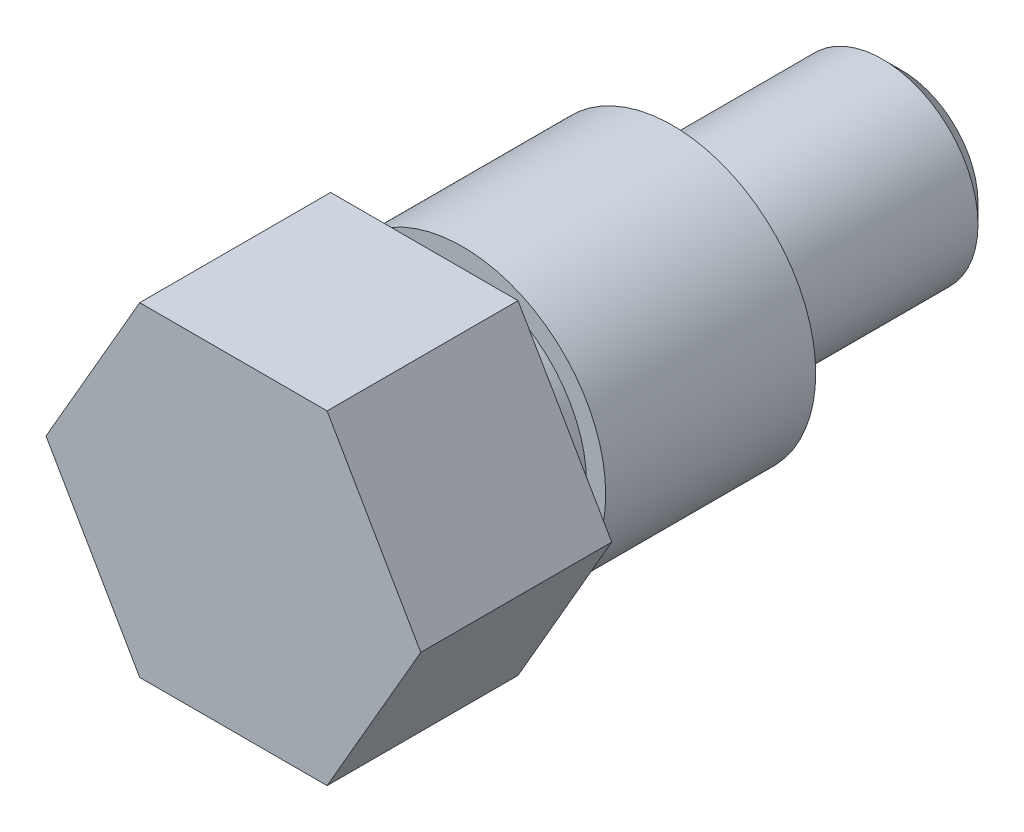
ISO-10303-21;
HEADER;
FILE_DESCRIPTION(('STEP AP214'),'2;1');
FILE_NAME('part.step','',(''),(''),'','','');
FILE_SCHEMA(('AUTOMOTIVE_DESIGN { 1 0 10303 214 1 1 1 1 }'));
ENDSEC;
DATA;
#1=APPLICATION_CONTEXT('core data for automotive mechanical design processes');
#2=APPLICATION_PROTOCOL_DEFINITION('international standard','automotive_design',2000,#1);
#3=PRODUCT_CONTEXT('',#1,'mechanical');
#4=PRODUCT('Part','Part','',(#3));
#5=PRODUCT_RELATED_PRODUCT_CATEGORY('part','',(#4));
#6=PRODUCT_DEFINITION_FORMATION('','',#4);
#7=PRODUCT_DEFINITION_CONTEXT('part definition',#1,'design');
#8=PRODUCT_DEFINITION('design','',#6,#7);
#9=PRODUCT_DEFINITION_SHAPE('','',#8);
#10=(LENGTH_UNIT() NAMED_UNIT(*) SI_UNIT(.MILLI.,.METRE.));
#11=(NAMED_UNIT(*) PLANE_ANGLE_UNIT() SI_UNIT($,.RADIAN.));
#12=(NAMED_UNIT(*) SI_UNIT($,.STERADIAN.) SOLID_ANGLE_UNIT());
#13=UNCERTAINTY_MEASURE_WITH_UNIT(LENGTH_MEASURE(1.E-05),#10,'distance_accuracy_value','');
#14=(GEOMETRIC_REPRESENTATION_CONTEXT(3) GLOBAL_UNCERTAINTY_ASSIGNED_CONTEXT((#13)) GLOBAL_UNIT_ASSIGNED_CONTEXT((#10,
#11,#12)) REPRESENTATION_CONTEXT('',''));
#15=CARTESIAN_POINT('',(0.,0.,0.));
#16=DIRECTION('',(0.,0.,1.));
#17=DIRECTION('',(1.,0.,0.));
#18=AXIS2_PLACEMENT_3D('',#15,#16,#17);
#19=CARTESIAN_POINT('',(1.09634523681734E-12,2.33146835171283E-12,-22.9999999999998));
#20=DIRECTION('',(0.,0.,0.99999999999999));
#21=DIRECTION('',(0.999999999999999,0.,0.));
#22=AXIS2_PLACEMENT_3D('',#19,#20,#21);
#23=CYLINDRICAL_SURFACE('',#22,7.5);
#24=CARTESIAN_POINT('',(1.09634523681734E-12,2.33146835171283E-12,-22.9999999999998));
#25=DIRECTION('',(0.,0.,0.99999999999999));
#26=DIRECTION('',(0.999999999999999,0.,0.));
#27=AXIS2_PLACEMENT_3D('',#24,#25,#26);
#28=CIRCLE('',#27,7.5);
#29=CARTESIAN_POINT('',(7.50000000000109,2.33105201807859E-12,-22.9999999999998));
#30=VERTEX_POINT('',#29);
#31=EDGE_CURVE('E137',#30,#30,#28,.F.);
#32=CARTESIAN_POINT('',(7.7715611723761E-13,2.99760216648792E-12,-11.9999999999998));
#33=DIRECTION('',(0.,0.,0.99999999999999));
#34=DIRECTION('',(0.999999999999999,0.,0.));
#35=AXIS2_PLACEMENT_3D('',#32,#33,#34);
#36=CIRCLE('',#35,7.5);
#37=CARTESIAN_POINT('',(7.50000000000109,2.33105201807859E-12,-11.9999999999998));
#38=VERTEX_POINT('',#37);
#39=EDGE_CURVE('E133',#38,#38,#36,.F.);
#40=CARTESIAN_POINT('',(7.50000000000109,2.33105201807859E-12,-22.9999999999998));
#41=CARTESIAN_POINT('',(7.50000000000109,2.33105201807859E-12,-22.8854166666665));
#42=CARTESIAN_POINT('',(7.50000000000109,2.33105201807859E-12,-22.7708333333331));
#43=CARTESIAN_POINT('',(7.50000000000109,2.33105201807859E-12,-22.5416666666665));
#44=CARTESIAN_POINT('',(7.50000000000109,2.33105201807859E-12,-22.4270833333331));
#45=CARTESIAN_POINT('',(7.50000000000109,2.33105201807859E-12,-22.1979166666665));
#46=CARTESIAN_POINT('',(7.50000000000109,2.33105201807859E-12,-22.0833333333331));
#47=CARTESIAN_POINT('',(7.50000000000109,2.33105201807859E-12,-21.8541666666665));
#48=CARTESIAN_POINT('',(7.50000000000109,2.33105201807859E-12,-21.7395833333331));
#49=CARTESIAN_POINT('',(7.50000000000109,2.33105201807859E-12,-21.5104166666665));
#50=CARTESIAN_POINT('',(7.50000000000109,2.33105201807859E-12,-21.3958333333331));
#51=CARTESIAN_POINT('',(7.50000000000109,2.33105201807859E-12,-21.1666666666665));
#52=CARTESIAN_POINT('',(7.50000000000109,2.33105201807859E-12,-21.0520833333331));
#53=CARTESIAN_POINT('',(7.50000000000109,2.33105201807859E-12,-20.8229166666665));
#54=CARTESIAN_POINT('',(7.50000000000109,2.33105201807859E-12,-20.7083333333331));
#55=CARTESIAN_POINT('',(7.50000000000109,2.33105201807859E-12,-20.4791666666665));
#56=CARTESIAN_POINT('',(7.50000000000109,2.33105201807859E-12,-20.3645833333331));
#57=CARTESIAN_POINT('',(7.50000000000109,2.33105201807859E-12,-20.1354166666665));
#58=CARTESIAN_POINT('',(7.50000000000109,2.33105201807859E-12,-20.0208333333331));
#59=CARTESIAN_POINT('',(7.50000000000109,2.33105201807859E-12,-19.7916666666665));
#60=CARTESIAN_POINT('',(7.50000000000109,2.33105201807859E-12,-19.6770833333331));
#61=CARTESIAN_POINT('',(7.50000000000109,2.33105201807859E-12,-19.4479166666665));
#62=CARTESIAN_POINT('',(7.50000000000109,2.33105201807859E-12,-19.3333333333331));
#63=CARTESIAN_POINT('',(7.50000000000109,2.33105201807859E-12,-19.1041666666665));
#64=CARTESIAN_POINT('',(7.50000000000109,2.33105201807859E-12,-18.9895833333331));
#65=CARTESIAN_POINT('',(7.50000000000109,2.33105201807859E-12,-18.7604166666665));
#66=CARTESIAN_POINT('',(7.50000000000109,2.33105201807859E-12,-18.6458333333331));
#67=CARTESIAN_POINT('',(7.50000000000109,2.33105201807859E-12,-18.4166666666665));
#68=CARTESIAN_POINT('',(7.50000000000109,2.33105201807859E-12,-18.3020833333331));
#69=CARTESIAN_POINT('',(7.50000000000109,2.33105201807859E-12,-18.0729166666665));
#70=CARTESIAN_POINT('',(7.50000000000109,2.33105201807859E-12,-17.9583333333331));
#71=CARTESIAN_POINT('',(7.50000000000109,2.33105201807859E-12,-17.7291666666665));
#72=CARTESIAN_POINT('',(7.50000000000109,2.33105201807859E-12,-17.6145833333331));
#73=CARTESIAN_POINT('',(7.50000000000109,2.33105201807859E-12,-17.3854166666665));
#74=CARTESIAN_POINT('',(7.50000000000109,2.33105201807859E-12,-17.2708333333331));
#75=CARTESIAN_POINT('',(7.50000000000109,2.33105201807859E-12,-17.0416666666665));
#76=CARTESIAN_POINT('',(7.50000000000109,2.33105201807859E-12,-16.9270833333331));
#77=CARTESIAN_POINT('',(7.50000000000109,2.33105201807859E-12,-16.6979166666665));
#78=CARTESIAN_POINT('',(7.50000000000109,2.33105201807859E-12,-16.5833333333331));
#79=CARTESIAN_POINT('',(7.50000000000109,2.33105201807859E-12,-16.3541666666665));
#80=CARTESIAN_POINT('',(7.50000000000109,2.33105201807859E-12,-16.2395833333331));
#81=CARTESIAN_POINT('',(7.50000000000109,2.33105201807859E-12,-16.0104166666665));
#82=CARTESIAN_POINT('',(7.50000000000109,2.33105201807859E-12,-15.8958333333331));
#83=CARTESIAN_POINT('',(7.50000000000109,2.33105201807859E-12,-15.6666666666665));
#84=CARTESIAN_POINT('',(7.50000000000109,2.33105201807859E-12,-15.5520833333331));
#85=CARTESIAN_POINT('',(7.50000000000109,2.33105201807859E-12,-15.3229166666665));
#86=CARTESIAN_POINT('',(7.50000000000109,2.33105201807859E-12,-15.2083333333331));
#87=CARTESIAN_POINT('',(7.50000000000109,2.33105201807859E-12,-14.9791666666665));
#88=CARTESIAN_POINT('',(7.50000000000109,2.33105201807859E-12,-14.8645833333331));
#89=CARTESIAN_POINT('',(7.50000000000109,2.33105201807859E-12,-14.6354166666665));
#90=CARTESIAN_POINT('',(7.50000000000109,2.33105201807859E-12,-14.5208333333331));
#91=CARTESIAN_POINT('',(7.50000000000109,2.33105201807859E-12,-14.2916666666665));
#92=CARTESIAN_POINT('',(7.50000000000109,2.33105201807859E-12,-14.1770833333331));
#93=CARTESIAN_POINT('',(7.50000000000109,2.33105201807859E-12,-13.9479166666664));
#94=CARTESIAN_POINT('',(7.50000000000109,2.33105201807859E-12,-13.8333333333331));
#95=CARTESIAN_POINT('',(7.50000000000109,2.33105201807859E-12,-13.6041666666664));
#96=CARTESIAN_POINT('',(7.50000000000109,2.33105201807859E-12,-13.4895833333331));
#97=CARTESIAN_POINT('',(7.50000000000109,2.33105201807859E-12,-13.2604166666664));
#98=CARTESIAN_POINT('',(7.50000000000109,2.33105201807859E-12,-13.1458333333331));
#99=CARTESIAN_POINT('',(7.50000000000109,2.33105201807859E-12,-12.9166666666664));
#100=CARTESIAN_POINT('',(7.50000000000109,2.33105201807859E-12,-12.8020833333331));
#101=CARTESIAN_POINT('',(7.50000000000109,2.33105201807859E-12,-12.5729166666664));
#102=CARTESIAN_POINT('',(7.50000000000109,2.33105201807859E-12,-12.4583333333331));
#103=CARTESIAN_POINT('',(7.50000000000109,2.33105201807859E-12,-12.2291666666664));
#104=CARTESIAN_POINT('',(7.50000000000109,2.33105201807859E-12,-12.1145833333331));
#105=CARTESIAN_POINT('',(7.50000000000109,2.33105201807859E-12,-11.9999999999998));
#106=B_SPLINE_CURVE_WITH_KNOTS('',3,(#40,#41,#42,#43,#44,#45,#46,#47,#48,#49,#50,#51,#52,#53,
#54,#55,#56,#57,#58,#59,#60,#61,#62,#63,#64,#65,#66,#67,#68,#69,#70,#71,#72,#73,#74,#75,#76,#77,
#78,#79,#80,#81,#82,#83,#84,#85,#86,#87,#88,#89,#90,#91,#92,#93,#94,#95,#96,#97,#98,#99,#100,
#101,#102,#103,#104,#105),.UNSPECIFIED.,.F.,.F.,(4,2,2,2,2,2,2,2,2,2,2,2,2,2,2,2,2,2,2,2,2,2,2,
2,2,2,2,2,2,2,2,2,4),(0.,0.34375,0.687500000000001,1.03125,1.375,1.71875,2.06250000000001,
2.40625000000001,2.75000000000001,3.09375000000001,3.43750000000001,3.78125000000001,
4.12500000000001,4.46875000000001,4.81250000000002,5.15625000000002,5.50000000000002,
5.84375000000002,6.18750000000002,6.53125000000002,6.87500000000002,7.21875000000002,
7.56250000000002,7.90625000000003,8.25000000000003,8.59375000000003,8.93750000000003,
9.28125000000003,9.62500000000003,9.96875000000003,10.3125,10.65625,11.),.UNSPECIFIED.);
#107=EDGE_CURVE('BSEAM43',#30,#38,#106,.T.);
#108=ORIENTED_EDGE('',*,*,#31,.F.);
#109=ORIENTED_EDGE('',*,*,#39,.T.);
#110=ORIENTED_EDGE('',*,*,#107,.T.);
#111=ORIENTED_EDGE('',*,*,#107,.F.);
#112=EDGE_LOOP('',(#108,#110,#109,#111));
#113=FACE_BOUND('',#112,.T.);
#114=ADVANCED_FACE('F43',(#113),#23,.T.);
#115=CARTESIAN_POINT('',(9.29811783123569E-13,2.55351295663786E-12,-22.9999999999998));
#116=DIRECTION('',(0.,0.,0.99999999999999));
#117=DIRECTION('',(0.999999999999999,0.,0.));
#118=AXIS2_PLACEMENT_3D('',#115,#116,#117);
#119=PLANE('',#118);
#120=ORIENTED_EDGE('',*,*,#31,.T.);
#121=EDGE_LOOP('',(#120));
#122=FACE_BOUND('',#121,.T.);
#123=CARTESIAN_POINT('',(1.09634523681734E-12,2.33146835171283E-12,-22.9999999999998));
#124=DIRECTION('',(0.,0.,-0.99999999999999));
#125=DIRECTION('',(-0.999999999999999,0.,0.));
#126=AXIS2_PLACEMENT_3D('',#123,#124,#125);
#127=CIRCLE('',#126,3.5);
#128=CARTESIAN_POINT('',(-3.4999999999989,2.33166264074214E-12,-22.9999999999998));
#129=VERTEX_POINT('',#128);
#130=EDGE_CURVE('E386',#129,#129,#127,.T.);
#131=ORIENTED_EDGE('',*,*,#130,.F.);
#132=EDGE_LOOP('',(#131));
#133=FACE_BOUND('',#132,.T.);
#134=ADVANCED_FACE('F164',(#122,#133),#119,.F.);
#135=CARTESIAN_POINT('',(6.66133814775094E-13,2.99760216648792E-12,-11.9999999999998));
#136=DIRECTION('',(0.,0.,0.99999999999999));
#137=DIRECTION('',(0.999999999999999,0.,0.));
#138=AXIS2_PLACEMENT_3D('',#135,#136,#137);
#139=PLANE('',#138);
#140=ORIENTED_EDGE('',*,*,#39,.F.);
#141=EDGE_LOOP('',(#140));
#142=FACE_BOUND('',#141,.T.);
#143=CARTESIAN_POINT('',(7.7715611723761E-13,2.99760216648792E-12,-11.9999999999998));
#144=DIRECTION('',(0.,0.,0.99999999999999));
#145=DIRECTION('',(0.999999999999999,0.,0.));
#146=AXIS2_PLACEMENT_3D('',#143,#144,#145);
#147=CIRCLE('',#146,6.5);
#148=CARTESIAN_POINT('',(6.50000000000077,2.99724134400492E-12,-11.9999999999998));
#149=VERTEX_POINT('',#148);
#150=EDGE_CURVE('E138',#149,#149,#147,.T.);
#151=ORIENTED_EDGE('',*,*,#150,.F.);
#152=EDGE_LOOP('',(#151));
#153=FACE_BOUND('',#152,.T.);
#154=ADVANCED_FACE('F170',(#142,#153),#139,.T.);
#155=CARTESIAN_POINT('',(7.7715611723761E-13,2.99760216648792E-12,-11.9999999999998));
#156=DIRECTION('',(0.,0.,0.99999999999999));
#157=DIRECTION('',(0.999999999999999,0.,0.));
#158=AXIS2_PLACEMENT_3D('',#155,#156,#157);
#159=CYLINDRICAL_SURFACE('',#158,6.5);
#160=CARTESIAN_POINT('',(6.52256026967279E-13,2.99760216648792E-12,-9.99999999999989));
#161=DIRECTION('',(0.,0.,0.99999999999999));
#162=DIRECTION('',(0.999999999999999,0.,0.));
#163=AXIS2_PLACEMENT_3D('',#160,#161,#162);
#164=CIRCLE('',#163,6.5);
#165=CARTESIAN_POINT('',(6.50000000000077,2.99724134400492E-12,-9.99999999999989));
#166=VERTEX_POINT('',#165);
#167=EDGE_CURVE('E334',#166,#166,#164,.T.);
#168=CARTESIAN_POINT('',(6.50000000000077,2.99724134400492E-12,-11.9999999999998));
#169=CARTESIAN_POINT('',(6.50000000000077,2.99724134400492E-12,-11.9791666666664));
#170=CARTESIAN_POINT('',(6.50000000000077,2.99724134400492E-12,-11.9583333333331));
#171=CARTESIAN_POINT('',(6.50000000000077,2.99724134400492E-12,-11.9166666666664));
#172=CARTESIAN_POINT('',(6.50000000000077,2.99724134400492E-12,-11.8958333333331));
#173=CARTESIAN_POINT('',(6.50000000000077,2.99724134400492E-12,-11.8541666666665));
#174=CARTESIAN_POINT('',(6.50000000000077,2.99724134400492E-12,-11.8333333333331));
#175=CARTESIAN_POINT('',(6.50000000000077,2.99724134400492E-12,-11.7916666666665));
#176=CARTESIAN_POINT('',(6.50000000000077,2.99724134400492E-12,-11.7708333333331));
#177=CARTESIAN_POINT('',(6.50000000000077,2.99724134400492E-12,-11.7291666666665));
#178=CARTESIAN_POINT('',(6.50000000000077,2.99724134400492E-12,-11.7083333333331));
#179=CARTESIAN_POINT('',(6.50000000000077,2.99724134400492E-12,-11.6666666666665));
#180=CARTESIAN_POINT('',(6.50000000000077,2.99724134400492E-12,-11.6458333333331));
#181=CARTESIAN_POINT('',(6.50000000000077,2.99724134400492E-12,-11.6041666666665));
#182=CARTESIAN_POINT('',(6.50000000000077,2.99724134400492E-12,-11.5833333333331));
#183=CARTESIAN_POINT('',(6.50000000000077,2.99724134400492E-12,-11.5416666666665));
#184=CARTESIAN_POINT('',(6.50000000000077,2.99724134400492E-12,-11.5208333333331));
#185=CARTESIAN_POINT('',(6.50000000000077,2.99724134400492E-12,-11.4791666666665));
#186=CARTESIAN_POINT('',(6.50000000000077,2.99724134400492E-12,-11.4583333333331));
#187=CARTESIAN_POINT('',(6.50000000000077,2.99724134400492E-12,-11.4166666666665));
#188=CARTESIAN_POINT('',(6.50000000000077,2.99724134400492E-12,-11.3958333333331));
#189=CARTESIAN_POINT('',(6.50000000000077,2.99724134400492E-12,-11.3541666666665));
#190=CARTESIAN_POINT('',(6.50000000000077,2.99724134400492E-12,-11.3333333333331));
#191=CARTESIAN_POINT('',(6.50000000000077,2.99724134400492E-12,-11.2916666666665));
#192=CARTESIAN_POINT('',(6.50000000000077,2.99724134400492E-12,-11.2708333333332));
#193=CARTESIAN_POINT('',(6.50000000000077,2.99724134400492E-12,-11.2291666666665));
#194=CARTESIAN_POINT('',(6.50000000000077,2.99724134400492E-12,-11.2083333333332));
#195=CARTESIAN_POINT('',(6.50000000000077,2.99724134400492E-12,-11.1666666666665));
#196=CARTESIAN_POINT('',(6.50000000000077,2.99724134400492E-12,-11.1458333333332));
#197=CARTESIAN_POINT('',(6.50000000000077,2.99724134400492E-12,-11.1041666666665));
#198=CARTESIAN_POINT('',(6.50000000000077,2.99724134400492E-12,-11.0833333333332));
#199=CARTESIAN_POINT('',(6.50000000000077,2.99724134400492E-12,-11.0416666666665));
#200=CARTESIAN_POINT('',(6.50000000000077,2.99724134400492E-12,-11.0208333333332));
#201=CARTESIAN_POINT('',(6.50000000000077,2.99724134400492E-12,-10.9791666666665));
#202=CARTESIAN_POINT('',(6.50000000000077,2.99724134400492E-12,-10.9583333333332));
#203=CARTESIAN_POINT('',(6.50000000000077,2.99724134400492E-12,-10.9166666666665));
#204=CARTESIAN_POINT('',(6.50000000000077,2.99724134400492E-12,-10.8958333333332));
#205=CARTESIAN_POINT('',(6.50000000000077,2.99724134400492E-12,-10.8541666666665));
#206=CARTESIAN_POINT('',(6.50000000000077,2.99724134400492E-12,-10.8333333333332));
#207=CARTESIAN_POINT('',(6.50000000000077,2.99724134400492E-12,-10.7916666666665));
#208=CARTESIAN_POINT('',(6.50000000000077,2.99724134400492E-12,-10.7708333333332));
#209=CARTESIAN_POINT('',(6.50000000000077,2.99724134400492E-12,-10.7291666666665));
#210=CARTESIAN_POINT('',(6.50000000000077,2.99724134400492E-12,-10.7083333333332));
#211=CARTESIAN_POINT('',(6.50000000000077,2.99724134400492E-12,-10.6666666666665));
#212=CARTESIAN_POINT('',(6.50000000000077,2.99724134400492E-12,-10.6458333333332));
#213=CARTESIAN_POINT('',(6.50000000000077,2.99724134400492E-12,-10.6041666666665));
#214=CARTESIAN_POINT('',(6.50000000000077,2.99724134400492E-12,-10.5833333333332));
#215=CARTESIAN_POINT('',(6.50000000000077,2.99724134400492E-12,-10.5416666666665));
#216=CARTESIAN_POINT('',(6.50000000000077,2.99724134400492E-12,-10.5208333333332));
#217=CARTESIAN_POINT('',(6.50000000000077,2.99724134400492E-12,-10.4791666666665));
#218=CARTESIAN_POINT('',(6.50000000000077,2.99724134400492E-12,-10.4583333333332));
#219=CARTESIAN_POINT('',(6.50000000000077,2.99724134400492E-12,-10.4166666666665));
#220=CARTESIAN_POINT('',(6.50000000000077,2.99724134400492E-12,-10.3958333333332));
#221=CARTESIAN_POINT('',(6.50000000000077,2.99724134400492E-12,-10.3541666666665));
#222=CARTESIAN_POINT('',(6.50000000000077,2.99724134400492E-12,-10.3333333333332));
#223=CARTESIAN_POINT('',(6.50000000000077,2.99724134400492E-12,-10.2916666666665));
#224=CARTESIAN_POINT('',(6.50000000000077,2.99724134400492E-12,-10.2708333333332));
#225=CARTESIAN_POINT('',(6.50000000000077,2.99724134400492E-12,-10.2291666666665));
#226=CARTESIAN_POINT('',(6.50000000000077,2.99724134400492E-12,-10.2083333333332));
#227=CARTESIAN_POINT('',(6.50000000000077,2.99724134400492E-12,-10.1666666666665));
#228=CARTESIAN_POINT('',(6.50000000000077,2.99724134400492E-12,-10.1458333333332));
#229=CARTESIAN_POINT('',(6.50000000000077,2.99724134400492E-12,-10.1041666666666));
#230=CARTESIAN_POINT('',(6.50000000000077,2.99724134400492E-12,-10.0833333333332));
#231=CARTESIAN_POINT('',(6.50000000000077,2.99724134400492E-12,-10.0416666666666));
#232=CARTESIAN_POINT('',(6.50000000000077,2.99724134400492E-12,-10.0208333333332));
#233=CARTESIAN_POINT('',(6.50000000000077,2.99724134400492E-12,-9.99999999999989));
#234=B_SPLINE_CURVE_WITH_KNOTS('',3,(#168,#169,#170,#171,#172,#173,#174,#175,#176,#177,#178,
#179,#180,#181,#182,#183,#184,#185,#186,#187,#188,#189,#190,#191,#192,#193,#194,#195,#196,#197,
#198,#199,#200,#201,#202,#203,#204,#205,#206,#207,#208,#209,#210,#211,#212,#213,#214,#215,#216,
#217,#218,#219,#220,#221,#222,#223,#224,#225,#226,#227,#228,#229,#230,#231,#232,#233),
.UNSPECIFIED.,.F.,.F.,(4,2,2,2,2,2,2,2,2,2,2,2,2,2,2,2,2,2,2,2,2,2,2,2,2,2,2,2,2,2,2,2,4),(0.,
0.0624999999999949,0.124999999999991,0.187499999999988,0.249999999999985,0.312499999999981,
0.374999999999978,0.437499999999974,0.499999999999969,0.562499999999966,0.624999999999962,
0.687499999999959,0.749999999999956,0.812499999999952,0.874999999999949,0.937499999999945,
0.99999999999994,1.06249999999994,1.12499999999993,1.18749999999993,1.24999999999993,
1.31249999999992,1.37499999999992,1.43749999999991,1.49999999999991,1.56249999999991,
1.6249999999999,1.6874999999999,1.7499999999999,1.81249999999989,1.87499999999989,
1.93749999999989,1.99999999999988),.UNSPECIFIED.);
#235=EDGE_CURVE('BSEAM181',#149,#166,#234,.T.);
#236=ORIENTED_EDGE('',*,*,#150,.T.);
#237=ORIENTED_EDGE('',*,*,#167,.F.);
#238=ORIENTED_EDGE('',*,*,#235,.T.);
#239=ORIENTED_EDGE('',*,*,#235,.F.);
#240=EDGE_LOOP('',(#236,#238,#237,#239));
#241=FACE_BOUND('',#240,.T.);
#242=ADVANCED_FACE('F181',(#241),#159,.T.);
#243=CARTESIAN_POINT('',(4.90747728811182,8.50000000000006,0.));
#244=DIRECTION('',(0.,0.,0.99999999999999));
#245=DIRECTION('',(0.999999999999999,0.,0.));
#246=AXIS2_PLACEMENT_3D('',#243,#244,#245);
#247=PLANE('',#246);
#248=DIRECTION('',(-0.49999999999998,0.86602540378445,0.));
#249=VECTOR('',#248,1.);
#250=CARTESIAN_POINT('',(4.90747728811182,8.50000000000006,0.));
#251=LINE('',#250,#249);
#252=CARTESIAN_POINT('',(9.81495457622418,1.4432899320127E-12,0.));
#253=VERTEX_POINT('',#252);
#254=CARTESIAN_POINT('',(4.90747728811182,8.50000000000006,0.));
#255=VERTEX_POINT('',#254);
#256=EDGE_CURVE('E111',#253,#255,#251,.T.);
#257=ORIENTED_EDGE('',*,*,#256,.T.);
#258=DIRECTION('',(-1.,0.,0.));
#259=VECTOR('',#258,1.);
#260=CARTESIAN_POINT('',(-4.90747728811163,8.50000000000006,1.17961196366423E-13));
#261=LINE('',#260,#259);
#262=CARTESIAN_POINT('',(-4.90747728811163,8.50000000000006,1.17961196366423E-13));
#263=VERTEX_POINT('',#262);
#264=EDGE_CURVE('E116',#255,#263,#261,.T.);
#265=ORIENTED_EDGE('',*,*,#264,.T.);
#266=DIRECTION('',(-0.499999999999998,-0.86602540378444,0.));
#267=VECTOR('',#266,1.);
#268=CARTESIAN_POINT('',(-9.81495457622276,1.4432899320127E-12,1.17961196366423E-13));
#269=LINE('',#268,#267);
#270=CARTESIAN_POINT('',(-9.81495457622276,1.4432899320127E-12,1.17961196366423E-13));
#271=VERTEX_POINT('',#270);
#272=EDGE_CURVE('E357',#263,#271,#269,.T.);
#273=ORIENTED_EDGE('',*,*,#272,.T.);
#274=DIRECTION('',(0.499999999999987,-0.866025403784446,0.));
#275=VECTOR('',#274,1.);
#276=CARTESIAN_POINT('',(-4.90747728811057,-8.49999999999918,0.));
#277=LINE('',#276,#275);
#278=CARTESIAN_POINT('',(-4.90747728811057,-8.49999999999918,0.));
#279=VERTEX_POINT('',#278);
#280=EDGE_CURVE('E361',#271,#279,#277,.T.);
#281=ORIENTED_EDGE('',*,*,#280,.T.);
#282=DIRECTION('',(0.999999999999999,0.,0.));
#283=VECTOR('',#282,1.);
#284=CARTESIAN_POINT('',(4.90747728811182,-8.49999999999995,0.));
#285=LINE('',#284,#283);
#286=CARTESIAN_POINT('',(4.90747728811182,-8.49999999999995,0.));
#287=VERTEX_POINT('',#286);
#288=EDGE_CURVE('E129',#279,#287,#285,.T.);
#289=ORIENTED_EDGE('',*,*,#288,.T.);
#290=DIRECTION('',(0.499999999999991,0.866025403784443,0.));
#291=VECTOR('',#290,1.);
#292=CARTESIAN_POINT('',(9.81495457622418,1.4432899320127E-12,0.));
#293=LINE('',#292,#291);
#294=EDGE_CURVE('E120',#287,#253,#293,.T.);
#295=ORIENTED_EDGE('',*,*,#294,.T.);
#296=EDGE_LOOP('',(#257,#265,#273,#281,#289,#295));
#297=FACE_BOUND('',#296,.T.);
#298=ADVANCED_FACE('F179',(#297),#247,.T.);
#299=CARTESIAN_POINT('',(-4.90747728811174,8.50000000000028,-35.));
#300=DIRECTION('',(0.,1.,0.));
#301=DIRECTION('',(-1.,0.,0.));
#302=AXIS2_PLACEMENT_3D('',#299,#300,#301);
#303=PLANE('',#302);
#304=DIRECTION('',(1.,0.,0.));
#305=VECTOR('',#304,1.);
#306=CARTESIAN_POINT('',(-4.90747728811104,8.50000000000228,-9.99999999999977));
#307=LINE('',#306,#305);
#308=CARTESIAN_POINT('',(-4.90747728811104,8.50000000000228,-9.99999999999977));
#309=VERTEX_POINT('',#308);
#310=CARTESIAN_POINT('',(4.90747728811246,8.50000000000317,-9.99999999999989));
#311=VERTEX_POINT('',#310);
#312=EDGE_CURVE('E97',#309,#311,#307,.T.);
#313=ORIENTED_EDGE('',*,*,#312,.F.);
#314=DIRECTION('',(0.,0.,0.99999999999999));
#315=VECTOR('',#314,1.);
#316=CARTESIAN_POINT('',(-4.90747728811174,8.50000000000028,-35.));
#317=LINE('',#316,#315);
#318=EDGE_CURVE('E119',#309,#263,#317,.T.);
#319=ORIENTED_EDGE('',*,*,#318,.T.);
#320=ORIENTED_EDGE('',*,*,#264,.F.);
#321=DIRECTION('',(0.,0.,0.99999999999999));
#322=VECTOR('',#321,1.);
#323=CARTESIAN_POINT('',(4.90747728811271,8.50000000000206,-34.9999999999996));
#324=LINE('',#323,#322);
#325=EDGE_CURVE('E108',#311,#255,#324,.T.);
#326=ORIENTED_EDGE('',*,*,#325,.F.);
#327=EDGE_LOOP('',(#313,#319,#320,#326));
#328=FACE_BOUND('',#327,.T.);
#329=ADVANCED_FACE('F114',(#328),#303,.T.);
#330=CARTESIAN_POINT('',(-9.81495457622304,2.66453525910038E-12,-34.9999999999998));
#331=DIRECTION('',(-0.866025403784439,0.499999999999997,0.));
#332=DIRECTION('',(-0.499999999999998,-0.86602540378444,0.));
#333=AXIS2_PLACEMENT_3D('',#330,#331,#332);
#334=PLANE('',#333);
#335=DIRECTION('',(0.499999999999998,0.86602540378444,0.));
#336=VECTOR('',#335,1.);
#337=CARTESIAN_POINT('',(-9.81495457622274,2.99760216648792E-12,-9.99999999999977));
#338=LINE('',#337,#336);
#339=CARTESIAN_POINT('',(-9.81495457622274,2.99760216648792E-12,-9.99999999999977));
#340=VERTEX_POINT('',#339);
#341=EDGE_CURVE('E60',#340,#309,#338,.T.);
#342=ORIENTED_EDGE('',*,*,#341,.F.);
#343=DIRECTION('',(0.,0.,0.99999999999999));
#344=VECTOR('',#343,1.);
#345=CARTESIAN_POINT('',(-9.81495457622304,2.66453525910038E-12,-34.9999999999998));
#346=LINE('',#345,#344);
#347=EDGE_CURVE('E125',#340,#271,#346,.T.);
#348=ORIENTED_EDGE('',*,*,#347,.T.);
#349=ORIENTED_EDGE('',*,*,#272,.F.);
#350=ORIENTED_EDGE('',*,*,#318,.F.);
#351=EDGE_LOOP('',(#342,#348,#349,#350));
#352=FACE_BOUND('',#351,.T.);
#353=ADVANCED_FACE('F194',(#352),#334,.T.);
#354=CARTESIAN_POINT('',(-4.90747728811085,-8.49999999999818,-34.9999999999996));
#355=DIRECTION('',(-0.866025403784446,-0.499999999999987,0.));
#356=DIRECTION('',(0.499999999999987,-0.866025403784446,0.));
#357=AXIS2_PLACEMENT_3D('',#354,#355,#356);
#358=PLANE('',#357);
#359=DIRECTION('',(-0.499999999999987,0.866025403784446,0.));
#360=VECTOR('',#359,1.);
#361=CARTESIAN_POINT('',(-4.90747728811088,-8.49999999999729,-9.99999999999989));
#362=LINE('',#361,#360);
#363=CARTESIAN_POINT('',(-4.90747728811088,-8.49999999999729,-9.99999999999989));
#364=VERTEX_POINT('',#363);
#365=EDGE_CURVE('E345',#364,#340,#362,.T.);
#366=ORIENTED_EDGE('',*,*,#365,.F.);
#367=DIRECTION('',(0.,0.,0.99999999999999));
#368=VECTOR('',#367,1.);
#369=CARTESIAN_POINT('',(-4.90747728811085,-8.49999999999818,-34.9999999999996));
#370=LINE('',#369,#368);
#371=EDGE_CURVE('E373',#364,#279,#370,.T.);
#372=ORIENTED_EDGE('',*,*,#371,.T.);
#373=ORIENTED_EDGE('',*,*,#280,.F.);
#374=ORIENTED_EDGE('',*,*,#347,.F.);
#375=EDGE_LOOP('',(#366,#372,#373,#374));
#376=FACE_BOUND('',#375,.T.);
#377=ADVANCED_FACE('F190',(#376),#358,.T.);
#378=CARTESIAN_POINT('',(4.90747728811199,-8.49999999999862,-34.9999999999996));
#379=DIRECTION('',(0.,-0.999999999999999,0.));
#380=DIRECTION('',(0.999999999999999,0.,0.));
#381=AXIS2_PLACEMENT_3D('',#378,#379,#380);
#382=PLANE('',#381);
#383=DIRECTION('',(-0.999999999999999,0.,0.));
#384=VECTOR('',#383,1.);
#385=CARTESIAN_POINT('',(4.90747728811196,-8.49999999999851,-9.99999999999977));
#386=LINE('',#385,#384);
#387=CARTESIAN_POINT('',(4.90747728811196,-8.49999999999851,-9.99999999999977));
#388=VERTEX_POINT('',#387);
#389=EDGE_CURVE('E348',#388,#364,#386,.T.);
#390=ORIENTED_EDGE('',*,*,#389,.F.);
#391=DIRECTION('',(0.,0.,0.99999999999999));
#392=VECTOR('',#391,1.);
#393=CARTESIAN_POINT('',(4.90747728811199,-8.49999999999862,-34.9999999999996));
#394=LINE('',#393,#392);
#395=EDGE_CURVE('E370',#388,#287,#394,.T.);
#396=ORIENTED_EDGE('',*,*,#395,.T.);
#397=ORIENTED_EDGE('',*,*,#288,.F.);
#398=ORIENTED_EDGE('',*,*,#371,.F.);
#399=EDGE_LOOP('',(#390,#396,#397,#398));
#400=FACE_BOUND('',#399,.T.);
#401=ADVANCED_FACE('F187',(#400),#382,.T.);
#402=CARTESIAN_POINT('',(9.8149545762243,2.33146835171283E-12,-34.9999999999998));
#403=DIRECTION('',(0.866025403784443,-0.499999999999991,0.));
#404=DIRECTION('',(0.499999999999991,0.866025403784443,0.));
#405=AXIS2_PLACEMENT_3D('',#402,#403,#404);
#406=PLANE('',#405);
#407=DIRECTION('',(-0.499999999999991,-0.866025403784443,0.));
#408=VECTOR('',#407,1.);
#409=CARTESIAN_POINT('',(9.81495457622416,3.21964677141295E-12,-9.99999999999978));
#410=LINE('',#409,#408);
#411=CARTESIAN_POINT('',(9.81495457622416,3.21964677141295E-12,-9.99999999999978));
#412=VERTEX_POINT('',#411);
#413=EDGE_CURVE('E112',#412,#388,#410,.T.);
#414=ORIENTED_EDGE('',*,*,#413,.F.);
#415=DIRECTION('',(0.,0.,0.99999999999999));
#416=VECTOR('',#415,1.);
#417=CARTESIAN_POINT('',(9.8149545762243,2.33146835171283E-12,-34.9999999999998));
#418=LINE('',#417,#416);
#419=EDGE_CURVE('E68',#412,#253,#418,.T.);
#420=ORIENTED_EDGE('',*,*,#419,.T.);
#421=ORIENTED_EDGE('',*,*,#294,.F.);
#422=ORIENTED_EDGE('',*,*,#395,.F.);
#423=EDGE_LOOP('',(#414,#420,#421,#422));
#424=FACE_BOUND('',#423,.T.);
#425=ADVANCED_FACE('F184',(#424),#406,.T.);
#426=CARTESIAN_POINT('',(4.90747728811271,8.50000000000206,-34.9999999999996));
#427=DIRECTION('',(0.86602540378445,0.49999999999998,0.));
#428=DIRECTION('',(-0.49999999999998,0.86602540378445,0.));
#429=AXIS2_PLACEMENT_3D('',#426,#427,#428);
#430=PLANE('',#429);
#431=DIRECTION('',(0.49999999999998,-0.86602540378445,0.));
#432=VECTOR('',#431,1.);
#433=CARTESIAN_POINT('',(4.90747728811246,8.50000000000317,-9.99999999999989));
#434=LINE('',#433,#432);
#435=EDGE_CURVE('E101',#311,#412,#434,.T.);
#436=ORIENTED_EDGE('',*,*,#435,.F.);
#437=ORIENTED_EDGE('',*,*,#325,.T.);
#438=ORIENTED_EDGE('',*,*,#256,.F.);
#439=ORIENTED_EDGE('',*,*,#419,.F.);
#440=EDGE_LOOP('',(#436,#437,#438,#439));
#441=FACE_BOUND('',#440,.T.);
#442=ADVANCED_FACE('F45',(#441),#430,.T.);
#443=CARTESIAN_POINT('',(6.52256026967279E-13,2.99760216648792E-12,-9.99999999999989));
#444=DIRECTION('',(0.,0.,0.99999999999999));
#445=DIRECTION('',(0.999999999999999,0.,0.));
#446=AXIS2_PLACEMENT_3D('',#443,#444,#445);
#447=PLANE('',#446);
#448=ORIENTED_EDGE('',*,*,#435,.T.);
#449=ORIENTED_EDGE('',*,*,#413,.T.);
#450=ORIENTED_EDGE('',*,*,#389,.T.);
#451=ORIENTED_EDGE('',*,*,#365,.T.);
#452=ORIENTED_EDGE('',*,*,#341,.T.);
#453=ORIENTED_EDGE('',*,*,#312,.T.);
#454=EDGE_LOOP('',(#448,#449,#450,#451,#452,#453));
#455=FACE_BOUND('',#454,.T.);
#456=ORIENTED_EDGE('',*,*,#167,.T.);
#457=EDGE_LOOP('',(#456));
#458=FACE_BOUND('',#457,.T.);
#459=ADVANCED_FACE('F99',(#455,#458),#447,.F.);
#460=CARTESIAN_POINT('',(7.50000000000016,1.22124532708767E-12,-24.4999999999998));
#461=DIRECTION('',(0.,0.,0.99999999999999));
#462=DIRECTION('',(0.999999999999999,0.,0.));
#463=AXIS2_PLACEMENT_3D('',#460,#461,#462);
#464=PLANE('',#463);
#465=CARTESIAN_POINT('',(9.29811783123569E-13,2.55351295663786E-12,-24.4999999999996));
#466=DIRECTION('',(0.,0.,0.99999999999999));
#467=DIRECTION('',(0.999999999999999,0.,0.));
#468=AXIS2_PLACEMENT_3D('',#465,#466,#467);
#469=CIRCLE('',#468,5.);
#470=CARTESIAN_POINT('',(5.00000000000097,1.99812388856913E-12,-24.4999999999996));
#471=VERTEX_POINT('',#470);
#472=EDGE_CURVE('E47',#471,#471,#469,.F.);
#473=ORIENTED_EDGE('',*,*,#472,.F.);
#474=EDGE_LOOP('',(#473));
#475=FACE_BOUND('',#474,.T.);
#476=CARTESIAN_POINT('',(9.29811783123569E-13,2.55351295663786E-12,-24.4999999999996));
#477=DIRECTION('',(0.,0.,-0.99999999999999));
#478=DIRECTION('',(-0.999999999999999,0.,0.));
#479=AXIS2_PLACEMENT_3D('',#476,#477,#478);
#480=CIRCLE('',#479,3.5);
#481=CARTESIAN_POINT('',(-3.4999999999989,2.33166264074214E-12,-24.4999999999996));
#482=VERTEX_POINT('',#481);
#483=EDGE_CURVE('E384',#482,#482,#480,.T.);
#484=ORIENTED_EDGE('',*,*,#483,.T.);
#485=EDGE_LOOP('',(#484));
#486=FACE_BOUND('',#485,.T.);
#487=ADVANCED_FACE('F178',(#475,#486),#464,.T.);
#488=CARTESIAN_POINT('',(1.09634523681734E-12,2.33146835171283E-12,-22.9999999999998));
#489=DIRECTION('',(0.,0.,-0.99999999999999));
#490=DIRECTION('',(-0.999999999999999,0.,0.));
#491=AXIS2_PLACEMENT_3D('',#488,#489,#490);
#492=CYLINDRICAL_SURFACE('',#491,3.5);
#493=CARTESIAN_POINT('',(-3.4999999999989,2.33166264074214E-12,-22.9999999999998));
#494=CARTESIAN_POINT('',(-3.4999999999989,2.33166264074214E-12,-23.0156249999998));
#495=CARTESIAN_POINT('',(-3.4999999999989,2.33166264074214E-12,-23.0312499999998));
#496=CARTESIAN_POINT('',(-3.4999999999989,2.33166264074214E-12,-23.0624999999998));
#497=CARTESIAN_POINT('',(-3.4999999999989,2.33166264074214E-12,-23.0781249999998));
#498=CARTESIAN_POINT('',(-3.4999999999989,2.33166264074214E-12,-23.1093749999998));
#499=CARTESIAN_POINT('',(-3.4999999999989,2.33166264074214E-12,-23.1249999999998));
#500=CARTESIAN_POINT('',(-3.4999999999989,2.33166264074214E-12,-23.1562499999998));
#501=CARTESIAN_POINT('',(-3.4999999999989,2.33166264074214E-12,-23.1718749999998));
#502=CARTESIAN_POINT('',(-3.4999999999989,2.33166264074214E-12,-23.2031249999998));
#503=CARTESIAN_POINT('',(-3.4999999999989,2.33166264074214E-12,-23.2187499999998));
#504=CARTESIAN_POINT('',(-3.4999999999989,2.33166264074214E-12,-23.2499999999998));
#505=CARTESIAN_POINT('',(-3.4999999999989,2.33166264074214E-12,-23.2656249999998));
#506=CARTESIAN_POINT('',(-3.4999999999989,2.33166264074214E-12,-23.2968749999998));
#507=CARTESIAN_POINT('',(-3.4999999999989,2.33166264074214E-12,-23.3124999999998));
#508=CARTESIAN_POINT('',(-3.4999999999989,2.33166264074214E-12,-23.3437499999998));
#509=CARTESIAN_POINT('',(-3.4999999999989,2.33166264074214E-12,-23.3593749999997));
#510=CARTESIAN_POINT('',(-3.4999999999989,2.33166264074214E-12,-23.3906249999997));
#511=CARTESIAN_POINT('',(-3.4999999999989,2.33166264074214E-12,-23.4062499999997));
#512=CARTESIAN_POINT('',(-3.4999999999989,2.33166264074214E-12,-23.4374999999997));
#513=CARTESIAN_POINT('',(-3.4999999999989,2.33166264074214E-12,-23.4531249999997));
#514=CARTESIAN_POINT('',(-3.4999999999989,2.33166264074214E-12,-23.4843749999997));
#515=CARTESIAN_POINT('',(-3.4999999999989,2.33166264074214E-12,-23.4999999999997));
#516=CARTESIAN_POINT('',(-3.4999999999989,2.33166264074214E-12,-23.5312499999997));
#517=CARTESIAN_POINT('',(-3.4999999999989,2.33166264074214E-12,-23.5468749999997));
#518=CARTESIAN_POINT('',(-3.4999999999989,2.33166264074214E-12,-23.5781249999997));
#519=CARTESIAN_POINT('',(-3.4999999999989,2.33166264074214E-12,-23.5937499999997));
#520=CARTESIAN_POINT('',(-3.4999999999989,2.33166264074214E-12,-23.6249999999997));
#521=CARTESIAN_POINT('',(-3.4999999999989,2.33166264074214E-12,-23.6406249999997));
#522=CARTESIAN_POINT('',(-3.4999999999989,2.33166264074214E-12,-23.6718749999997));
#523=CARTESIAN_POINT('',(-3.4999999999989,2.33166264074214E-12,-23.6874999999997));
#524=CARTESIAN_POINT('',(-3.4999999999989,2.33166264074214E-12,-23.7187499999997));
#525=CARTESIAN_POINT('',(-3.4999999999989,2.33166264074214E-12,-23.7343749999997));
#526=CARTESIAN_POINT('',(-3.4999999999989,2.33166264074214E-12,-23.7656249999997));
#527=CARTESIAN_POINT('',(-3.4999999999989,2.33166264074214E-12,-23.7812499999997));
#528=CARTESIAN_POINT('',(-3.4999999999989,2.33166264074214E-12,-23.8124999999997));
#529=CARTESIAN_POINT('',(-3.4999999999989,2.33166264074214E-12,-23.8281249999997));
#530=CARTESIAN_POINT('',(-3.4999999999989,2.33166264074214E-12,-23.8593749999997));
#531=CARTESIAN_POINT('',(-3.4999999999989,2.33166264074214E-12,-23.8749999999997));
#532=CARTESIAN_POINT('',(-3.4999999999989,2.33166264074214E-12,-23.9062499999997));
#533=CARTESIAN_POINT('',(-3.4999999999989,2.33166264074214E-12,-23.9218749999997));
#534=CARTESIAN_POINT('',(-3.4999999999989,2.33166264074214E-12,-23.9531249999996));
#535=CARTESIAN_POINT('',(-3.4999999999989,2.33166264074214E-12,-23.9687499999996));
#536=CARTESIAN_POINT('',(-3.4999999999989,2.33166264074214E-12,-23.9999999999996));
#537=CARTESIAN_POINT('',(-3.4999999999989,2.33166264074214E-12,-24.0156249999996));
#538=CARTESIAN_POINT('',(-3.4999999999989,2.33166264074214E-12,-24.0468749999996));
#539=CARTESIAN_POINT('',(-3.4999999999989,2.33166264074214E-12,-24.0624999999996));
#540=CARTESIAN_POINT('',(-3.4999999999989,2.33166264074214E-12,-24.0937499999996));
#541=CARTESIAN_POINT('',(-3.4999999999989,2.33166264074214E-12,-24.1093749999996));
#542=CARTESIAN_POINT('',(-3.4999999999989,2.33166264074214E-12,-24.1406249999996));
#543=CARTESIAN_POINT('',(-3.4999999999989,2.33166264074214E-12,-24.1562499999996));
#544=CARTESIAN_POINT('',(-3.4999999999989,2.33166264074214E-12,-24.1874999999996));
#545=CARTESIAN_POINT('',(-3.4999999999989,2.33166264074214E-12,-24.2031249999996));
#546=CARTESIAN_POINT('',(-3.4999999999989,2.33166264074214E-12,-24.2343749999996));
#547=CARTESIAN_POINT('',(-3.4999999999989,2.33166264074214E-12,-24.2499999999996));
#548=CARTESIAN_POINT('',(-3.4999999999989,2.33166264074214E-12,-24.2812499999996));
#549=CARTESIAN_POINT('',(-3.4999999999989,2.33166264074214E-12,-24.2968749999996));
#550=CARTESIAN_POINT('',(-3.4999999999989,2.33166264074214E-12,-24.3281249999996));
#551=CARTESIAN_POINT('',(-3.4999999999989,2.33166264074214E-12,-24.3437499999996));
#552=CARTESIAN_POINT('',(-3.4999999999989,2.33166264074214E-12,-24.3749999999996));
#553=CARTESIAN_POINT('',(-3.4999999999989,2.33166264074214E-12,-24.3906249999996));
#554=CARTESIAN_POINT('',(-3.4999999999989,2.33166264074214E-12,-24.4218749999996));
#555=CARTESIAN_POINT('',(-3.4999999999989,2.33166264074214E-12,-24.4374999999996));
#556=CARTESIAN_POINT('',(-3.4999999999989,2.33166264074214E-12,-24.4687499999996));
#557=CARTESIAN_POINT('',(-3.4999999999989,2.33166264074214E-12,-24.4843749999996));
#558=CARTESIAN_POINT('',(-3.4999999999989,2.33166264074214E-12,-24.4999999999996));
#559=B_SPLINE_CURVE_WITH_KNOTS('',3,(#493,#494,#495,#496,#497,#498,#499,#500,#501,#502,#503,
#504,#505,#506,#507,#508,#509,#510,#511,#512,#513,#514,#515,#516,#517,#518,#519,#520,#521,#522,
#523,#524,#525,#526,#527,#528,#529,#530,#531,#532,#533,#534,#535,#536,#537,#538,#539,#540,#541,
#542,#543,#544,#545,#546,#547,#548,#549,#550,#551,#552,#553,#554,#555,#556,#557,#558),
.UNSPECIFIED.,.F.,.F.,(4,2,2,2,2,2,2,2,2,2,2,2,2,2,2,2,2,2,2,2,2,2,2,2,2,2,2,2,2,2,2,2,4),(0.,
0.0468749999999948,0.0937499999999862,0.140624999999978,0.187499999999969,0.23437499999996,
0.281249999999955,0.328124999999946,0.374999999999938,0.421874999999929,0.468749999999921,
0.515624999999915,0.562499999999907,0.609374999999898,0.65624999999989,0.703124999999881,
0.749999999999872,0.796874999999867,0.843749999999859,0.89062499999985,0.937499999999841,
0.984374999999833,1.03124999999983,1.07812499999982,1.12499999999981,1.1718749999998,
1.21874999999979,1.26562499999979,1.31249999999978,1.35937499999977,1.40624999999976,
1.45312499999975,1.49999999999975),.UNSPECIFIED.);
#560=EDGE_CURVE('BSEAM157',#129,#482,#559,.T.);
#561=ORIENTED_EDGE('',*,*,#130,.T.);
#562=ORIENTED_EDGE('',*,*,#483,.F.);
#563=ORIENTED_EDGE('',*,*,#560,.T.);
#564=ORIENTED_EDGE('',*,*,#560,.F.);
#565=EDGE_LOOP('',(#561,#563,#562,#564));
#566=FACE_BOUND('',#565,.T.);
#567=ADVANCED_FACE('F157',(#566),#492,.T.);
#568=CARTESIAN_POINT('',(4.90747728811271,8.50000000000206,-34.9999999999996));
#569=DIRECTION('',(0.,0.,0.99999999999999));
#570=DIRECTION('',(0.999999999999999,0.,0.));
#571=AXIS2_PLACEMENT_3D('',#568,#569,#570);
#572=PLANE('',#571);
#573=CARTESIAN_POINT('',(6.24500451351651E-13,1.99840144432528E-12,-34.9999999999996));
#574=DIRECTION('',(0.,0.,0.99999999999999));
#575=DIRECTION('',(0.999999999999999,0.,0.));
#576=AXIS2_PLACEMENT_3D('',#573,#574,#575);
#577=CIRCLE('',#576,3.99999999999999);
#578=CARTESIAN_POINT('',(4.00000000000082,2.22022400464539E-12,-34.9999999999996));
#579=VERTEX_POINT('',#578);
#580=EDGE_CURVE('E12',#579,#579,#577,.F.);
#581=ORIENTED_EDGE('',*,*,#580,.T.);
#582=EDGE_LOOP('',(#581));
#583=FACE_BOUND('',#582,.T.);
#584=ADVANCED_FACE('F149',(#583),#572,.F.);
#585=CARTESIAN_POINT('',(8.46545056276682E-13,2.22044604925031E-12,-33.9999999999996));
#586=DIRECTION('',(0.,0.,0.99999999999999));
#587=DIRECTION('',(0.999999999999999,0.,0.));
#588=AXIS2_PLACEMENT_3D('',#585,#586,#587);
#589=CONICAL_SURFACE('',#588,5.,0.785398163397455);
#590=CARTESIAN_POINT('',(8.46545056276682E-13,2.22044604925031E-12,-33.9999999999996));
#591=DIRECTION('',(0.,0.,0.99999999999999));
#592=DIRECTION('',(0.999999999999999,0.,0.));
#593=AXIS2_PLACEMENT_3D('',#590,#591,#592);
#594=CIRCLE('',#593,5.);
#595=CARTESIAN_POINT('',(5.00000000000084,2.22016849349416E-12,-33.9999999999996));
#596=VERTEX_POINT('',#595);
#597=EDGE_CURVE('E53',#596,#596,#594,.T.);
#598=CARTESIAN_POINT('',(4.00000000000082,2.22022400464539E-12,-34.9999999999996));
#599=CARTESIAN_POINT('',(4.01041666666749,2.22022342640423E-12,-34.9895833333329));
#600=CARTESIAN_POINT('',(4.02083333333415,2.22022284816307E-12,-34.9791666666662));
#601=CARTESIAN_POINT('',(4.04166666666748,2.22022169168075E-12,-34.9583333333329));
#602=CARTESIAN_POINT('',(4.05208333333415,2.2202211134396E-12,-34.9479166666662));
#603=CARTESIAN_POINT('',(4.07291666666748,2.22021995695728E-12,-34.9270833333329));
#604=CARTESIAN_POINT('',(4.08333333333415,2.22021937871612E-12,-34.9166666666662));
#605=CARTESIAN_POINT('',(4.10416666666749,2.2202182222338E-12,-34.8958333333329));
#606=CARTESIAN_POINT('',(4.11458333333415,2.22021764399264E-12,-34.8854166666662));
#607=CARTESIAN_POINT('',(4.13541666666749,2.22021648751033E-12,-34.8645833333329));
#608=CARTESIAN_POINT('',(4.14583333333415,2.22021590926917E-12,-34.8541666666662));
#609=CARTESIAN_POINT('',(4.16666666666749,2.22021475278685E-12,-34.8333333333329));
#610=CARTESIAN_POINT('',(4.17708333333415,2.22021417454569E-12,-34.8229166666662));
#611=CARTESIAN_POINT('',(4.19791666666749,2.22021301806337E-12,-34.8020833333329));
#612=CARTESIAN_POINT('',(4.20833333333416,2.22021243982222E-12,-34.7916666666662));
#613=CARTESIAN_POINT('',(4.22916666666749,2.2202112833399E-12,-34.7708333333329));
#614=CARTESIAN_POINT('',(4.23958333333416,2.22021070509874E-12,-34.7604166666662));
#615=CARTESIAN_POINT('',(4.26041666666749,2.22020954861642E-12,-34.7395833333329));
#616=CARTESIAN_POINT('',(4.27083333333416,2.22020897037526E-12,-34.7291666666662));
#617=CARTESIAN_POINT('',(4.29166666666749,2.22020781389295E-12,-34.7083333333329));
#618=CARTESIAN_POINT('',(4.30208333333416,2.22020723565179E-12,-34.6979166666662));
#619=CARTESIAN_POINT('',(4.32291666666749,2.22020607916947E-12,-34.6770833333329));
#620=CARTESIAN_POINT('',(4.33333333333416,2.22020550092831E-12,-34.6666666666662));
#621=CARTESIAN_POINT('',(4.35416666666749,2.22020434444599E-12,-34.6458333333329));
#622=CARTESIAN_POINT('',(4.36458333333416,2.22020376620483E-12,-34.6354166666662));
#623=CARTESIAN_POINT('',(4.38541666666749,2.22020260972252E-12,-34.6145833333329));
#624=CARTESIAN_POINT('',(4.39583333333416,2.22020203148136E-12,-34.6041666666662));
#625=CARTESIAN_POINT('',(4.41666666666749,2.22020087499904E-12,-34.5833333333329));
#626=CARTESIAN_POINT('',(4.42708333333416,2.22020029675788E-12,-34.5729166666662));
#627=CARTESIAN_POINT('',(4.44791666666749,2.22019914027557E-12,-34.5520833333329));
#628=CARTESIAN_POINT('',(4.45833333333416,2.22019856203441E-12,-34.5416666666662));
#629=CARTESIAN_POINT('',(4.4791666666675,2.22019740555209E-12,-34.5208333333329));
#630=CARTESIAN_POINT('',(4.48958333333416,2.22019682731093E-12,-34.5104166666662));
#631=CARTESIAN_POINT('',(4.5104166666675,2.22019567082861E-12,-34.4895833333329));
#632=CARTESIAN_POINT('',(4.52083333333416,2.22019509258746E-12,-34.4791666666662));
#633=CARTESIAN_POINT('',(4.5416666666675,2.22019393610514E-12,-34.4583333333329));
#634=CARTESIAN_POINT('',(4.55208333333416,2.22019335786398E-12,-34.4479166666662));
#635=CARTESIAN_POINT('',(4.5729166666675,2.22019220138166E-12,-34.4270833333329));
#636=CARTESIAN_POINT('',(4.58333333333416,2.2201916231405E-12,-34.4166666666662));
#637=CARTESIAN_POINT('',(4.6041666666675,2.22019046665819E-12,-34.3958333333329));
#638=CARTESIAN_POINT('',(4.61458333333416,2.22018988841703E-12,-34.3854166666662));
#639=CARTESIAN_POINT('',(4.6354166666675,2.22018873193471E-12,-34.3645833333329));
#640=CARTESIAN_POINT('',(4.64583333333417,2.22018815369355E-12,-34.3541666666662));
#641=CARTESIAN_POINT('',(4.6666666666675,2.22018699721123E-12,-34.3333333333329));
#642=CARTESIAN_POINT('',(4.67708333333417,2.22018641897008E-12,-34.3229166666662));
#643=CARTESIAN_POINT('',(4.6979166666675,2.22018526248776E-12,-34.3020833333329));
#644=CARTESIAN_POINT('',(4.70833333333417,2.2201846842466E-12,-34.2916666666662));
#645=CARTESIAN_POINT('',(4.7291666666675,2.22018352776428E-12,-34.2708333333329));
#646=CARTESIAN_POINT('',(4.73958333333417,2.22018294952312E-12,-34.2604166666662));
#647=CARTESIAN_POINT('',(4.7604166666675,2.22018179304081E-12,-34.2395833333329));
#648=CARTESIAN_POINT('',(4.77083333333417,2.22018121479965E-12,-34.2291666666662));
#649=CARTESIAN_POINT('',(4.7916666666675,2.22018005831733E-12,-34.2083333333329));
#650=CARTESIAN_POINT('',(4.80208333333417,2.22017948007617E-12,-34.1979166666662));
#651=CARTESIAN_POINT('',(4.8229166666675,2.22017832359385E-12,-34.1770833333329));
#652=CARTESIAN_POINT('',(4.83333333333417,2.2201777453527E-12,-34.1666666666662));
#653=CARTESIAN_POINT('',(4.8541666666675,2.22017658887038E-12,-34.1458333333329));
#654=CARTESIAN_POINT('',(4.86458333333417,2.22017601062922E-12,-34.1354166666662));
#655=CARTESIAN_POINT('',(4.8854166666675,2.2201748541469E-12,-34.1145833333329));
#656=CARTESIAN_POINT('',(4.89583333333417,2.22017427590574E-12,-34.1041666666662));
#657=CARTESIAN_POINT('',(4.91666666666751,2.22017311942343E-12,-34.0833333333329));
#658=CARTESIAN_POINT('',(4.92708333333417,2.22017254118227E-12,-34.0729166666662));
#659=CARTESIAN_POINT('',(4.94791666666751,2.22017138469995E-12,-34.0520833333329));
#660=CARTESIAN_POINT('',(4.95833333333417,2.22017080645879E-12,-34.0416666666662));
#661=CARTESIAN_POINT('',(4.97916666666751,2.22016964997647E-12,-34.0208333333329));
#662=CARTESIAN_POINT('',(4.98958333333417,2.22016907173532E-12,-34.0104166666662));
#663=CARTESIAN_POINT('',(5.00000000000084,2.22016849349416E-12,-33.9999999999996));
#664=B_SPLINE_CURVE_WITH_KNOTS('',3,(#598,#599,#600,#601,#602,#603,#604,#605,#606,#607,#608,
#609,#610,#611,#612,#613,#614,#615,#616,#617,#618,#619,#620,#621,#622,#623,#624,#625,#626,#627,
#628,#629,#630,#631,#632,#633,#634,#635,#636,#637,#638,#639,#640,#641,#642,#643,#644,#645,#646,
#647,#648,#649,#650,#651,#652,#653,#654,#655,#656,#657,#658,#659,#660,#661,#662,#663),
.UNSPECIFIED.,.F.,.F.,(4,2,2,2,2,2,2,2,2,2,2,2,2,2,2,2,2,2,2,2,2,2,2,2,2,2,2,2,2,2,2,2,4),(0.,
0.0441941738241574,0.0883883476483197,0.132582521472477,0.176776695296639,0.220970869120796,
0.265165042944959,0.309359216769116,0.353553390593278,0.397747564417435,0.441941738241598,
0.486135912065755,0.530330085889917,0.574524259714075,0.618718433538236,0.662912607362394,
0.707106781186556,0.751300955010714,0.795495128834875,0.839689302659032,0.883883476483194,
0.928077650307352,0.972271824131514,1.01646599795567,1.06066017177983,1.10485434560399,
1.14904851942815,1.19324269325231,1.23743686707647,1.28163104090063,1.32582521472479,
1.37001938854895,1.41421356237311),.UNSPECIFIED.);
#665=EDGE_CURVE('BSEAM147',#579,#596,#664,.T.);
#666=ORIENTED_EDGE('',*,*,#580,.F.);
#667=ORIENTED_EDGE('',*,*,#597,.F.);
#668=ORIENTED_EDGE('',*,*,#665,.T.);
#669=ORIENTED_EDGE('',*,*,#665,.F.);
#670=EDGE_LOOP('',(#666,#668,#667,#669));
#671=FACE_BOUND('',#670,.T.);
#672=ADVANCED_FACE('F147',(#671),#589,.T.);
#673=CARTESIAN_POINT('',(9.71445146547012E-13,1.99840144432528E-12,-37.9999999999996));
#674=DIRECTION('',(0.,0.,0.99999999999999));
#675=DIRECTION('',(0.999999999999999,0.,0.));
#676=AXIS2_PLACEMENT_3D('',#673,#674,#675);
#677=CYLINDRICAL_SURFACE('',#676,5.);
#678=CARTESIAN_POINT('',(5.00000000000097,1.99812388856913E-12,-33.9999999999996));
#679=CARTESIAN_POINT('',(5.00000000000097,1.99812388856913E-12,-33.9010416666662));
#680=CARTESIAN_POINT('',(5.00000000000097,1.99812388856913E-12,-33.8020833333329));
#681=CARTESIAN_POINT('',(5.00000000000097,1.99812388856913E-12,-33.6041666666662));
#682=CARTESIAN_POINT('',(5.00000000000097,1.99812388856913E-12,-33.5052083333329));
#683=CARTESIAN_POINT('',(5.00000000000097,1.99812388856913E-12,-33.3072916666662));
#684=CARTESIAN_POINT('',(5.00000000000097,1.99812388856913E-12,-33.2083333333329));
#685=CARTESIAN_POINT('',(5.00000000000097,1.99812388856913E-12,-33.0104166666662));
#686=CARTESIAN_POINT('',(5.00000000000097,1.99812388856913E-12,-32.9114583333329));
#687=CARTESIAN_POINT('',(5.00000000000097,1.99812388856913E-12,-32.7135416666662));
#688=CARTESIAN_POINT('',(5.00000000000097,1.99812388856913E-12,-32.6145833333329));
#689=CARTESIAN_POINT('',(5.00000000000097,1.99812388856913E-12,-32.4166666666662));
#690=CARTESIAN_POINT('',(5.00000000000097,1.99812388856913E-12,-32.3177083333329));
#691=CARTESIAN_POINT('',(5.00000000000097,1.99812388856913E-12,-32.1197916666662));
#692=CARTESIAN_POINT('',(5.00000000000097,1.99812388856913E-12,-32.0208333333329));
#693=CARTESIAN_POINT('',(5.00000000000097,1.99812388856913E-12,-31.8229166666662));
#694=CARTESIAN_POINT('',(5.00000000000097,1.99812388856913E-12,-31.7239583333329));
#695=CARTESIAN_POINT('',(5.00000000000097,1.99812388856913E-12,-31.5260416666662));
#696=CARTESIAN_POINT('',(5.00000000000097,1.99812388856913E-12,-31.4270833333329));
#697=CARTESIAN_POINT('',(5.00000000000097,1.99812388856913E-12,-31.2291666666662));
#698=CARTESIAN_POINT('',(5.00000000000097,1.99812388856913E-12,-31.1302083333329));
#699=CARTESIAN_POINT('',(5.00000000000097,1.99812388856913E-12,-30.9322916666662));
#700=CARTESIAN_POINT('',(5.00000000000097,1.99812388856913E-12,-30.8333333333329));
#701=CARTESIAN_POINT('',(5.00000000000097,1.99812388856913E-12,-30.6354166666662));
#702=CARTESIAN_POINT('',(5.00000000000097,1.99812388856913E-12,-30.5364583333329));
#703=CARTESIAN_POINT('',(5.00000000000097,1.99812388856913E-12,-30.3385416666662));
#704=CARTESIAN_POINT('',(5.00000000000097,1.99812388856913E-12,-30.2395833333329));
#705=CARTESIAN_POINT('',(5.00000000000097,1.99812388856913E-12,-30.0416666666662));
#706=CARTESIAN_POINT('',(5.00000000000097,1.99812388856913E-12,-29.9427083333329));
#707=CARTESIAN_POINT('',(5.00000000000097,1.99812388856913E-12,-29.7447916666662));
#708=CARTESIAN_POINT('',(5.00000000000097,1.99812388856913E-12,-29.6458333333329));
#709=CARTESIAN_POINT('',(5.00000000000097,1.99812388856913E-12,-29.4479166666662));
#710=CARTESIAN_POINT('',(5.00000000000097,1.99812388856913E-12,-29.3489583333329));
#711=CARTESIAN_POINT('',(5.00000000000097,1.99812388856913E-12,-29.1510416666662));
#712=CARTESIAN_POINT('',(5.00000000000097,1.99812388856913E-12,-29.0520833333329));
#713=CARTESIAN_POINT('',(5.00000000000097,1.99812388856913E-12,-28.8541666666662));
#714=CARTESIAN_POINT('',(5.00000000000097,1.99812388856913E-12,-28.7552083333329));
#715=CARTESIAN_POINT('',(5.00000000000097,1.99812388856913E-12,-28.5572916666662));
#716=CARTESIAN_POINT('',(5.00000000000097,1.99812388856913E-12,-28.4583333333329));
#717=CARTESIAN_POINT('',(5.00000000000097,1.99812388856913E-12,-28.2604166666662));
#718=CARTESIAN_POINT('',(5.00000000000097,1.99812388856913E-12,-28.1614583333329));
#719=CARTESIAN_POINT('',(5.00000000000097,1.99812388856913E-12,-27.9635416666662));
#720=CARTESIAN_POINT('',(5.00000000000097,1.99812388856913E-12,-27.8645833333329));
#721=CARTESIAN_POINT('',(5.00000000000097,1.99812388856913E-12,-27.6666666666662));
#722=CARTESIAN_POINT('',(5.00000000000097,1.99812388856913E-12,-27.5677083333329));
#723=CARTESIAN_POINT('',(5.00000000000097,1.99812388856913E-12,-27.3697916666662));
#724=CARTESIAN_POINT('',(5.00000000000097,1.99812388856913E-12,-27.2708333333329));
#725=CARTESIAN_POINT('',(5.00000000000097,1.99812388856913E-12,-27.0729166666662));
#726=CARTESIAN_POINT('',(5.00000000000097,1.99812388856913E-12,-26.9739583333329));
#727=CARTESIAN_POINT('',(5.00000000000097,1.99812388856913E-12,-26.7760416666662));
#728=CARTESIAN_POINT('',(5.00000000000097,1.99812388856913E-12,-26.6770833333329));
#729=CARTESIAN_POINT('',(5.00000000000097,1.99812388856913E-12,-26.4791666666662));
#730=CARTESIAN_POINT('',(5.00000000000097,1.99812388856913E-12,-26.3802083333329));
#731=CARTESIAN_POINT('',(5.00000000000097,1.99812388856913E-12,-26.1822916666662));
#732=CARTESIAN_POINT('',(5.00000000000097,1.99812388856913E-12,-26.0833333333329));
#733=CARTESIAN_POINT('',(5.00000000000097,1.99812388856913E-12,-25.8854166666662));
#734=CARTESIAN_POINT('',(5.00000000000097,1.99812388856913E-12,-25.7864583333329));
#735=CARTESIAN_POINT('',(5.00000000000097,1.99812388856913E-12,-25.5885416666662));
#736=CARTESIAN_POINT('',(5.00000000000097,1.99812388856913E-12,-25.4895833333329));
#737=CARTESIAN_POINT('',(5.00000000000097,1.99812388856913E-12,-25.2916666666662));
#738=CARTESIAN_POINT('',(5.00000000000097,1.99812388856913E-12,-25.1927083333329));
#739=CARTESIAN_POINT('',(5.00000000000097,1.99812388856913E-12,-24.9947916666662));
#740=CARTESIAN_POINT('',(5.00000000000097,1.99812388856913E-12,-24.8958333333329));
#741=CARTESIAN_POINT('',(5.00000000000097,1.99812388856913E-12,-24.6979166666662));
#742=CARTESIAN_POINT('',(5.00000000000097,1.99812388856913E-12,-24.5989583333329));
#743=CARTESIAN_POINT('',(5.00000000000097,1.99812388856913E-12,-24.4999999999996));
#744=B_SPLINE_CURVE_WITH_KNOTS('',3,(#678,#679,#680,#681,#682,#683,#684,#685,#686,#687,#688,
#689,#690,#691,#692,#693,#694,#695,#696,#697,#698,#699,#700,#701,#702,#703,#704,#705,#706,#707,
#708,#709,#710,#711,#712,#713,#714,#715,#716,#717,#718,#719,#720,#721,#722,#723,#724,#725,#726,
#727,#728,#729,#730,#731,#732,#733,#734,#735,#736,#737,#738,#739,#740,#741,#742,#743),
.UNSPECIFIED.,.F.,.F.,(4,2,2,2,2,2,2,2,2,2,2,2,2,2,2,2,2,2,2,2,2,2,2,2,2,2,2,2,2,2,2,2,4),(0.,
0.296874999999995,0.593749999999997,0.890624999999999,1.1875,1.484375,1.78125,2.078125,2.375,
2.671875,2.96875,3.265625,3.5625,3.859375,4.15625,4.453125,4.75,5.046875,5.34375,5.640625,
5.9375,6.234375,6.53125,6.828125,7.125,7.421875,7.71875,8.01562500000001,8.3125,8.609375,
8.90625,9.20312500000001,9.50000000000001),.UNSPECIFIED.);
#745=EDGE_CURVE('BSEAM144',#596,#471,#744,.T.);
#746=ORIENTED_EDGE('',*,*,#597,.T.);
#747=ORIENTED_EDGE('',*,*,#472,.T.);
#748=ORIENTED_EDGE('',*,*,#745,.T.);
#749=ORIENTED_EDGE('',*,*,#745,.F.);
#750=EDGE_LOOP('',(#746,#748,#747,#749));
#751=FACE_BOUND('',#750,.T.);
#752=ADVANCED_FACE('F144',(#751),#677,.T.);
#753=CLOSED_SHELL('',(#114,#134,#154,#242,#298,#329,#353,#377,#401,#425,#442,#459,#487,#567,
#584,#672,#752));
#754=MANIFOLD_SOLID_BREP('B2',#753);
#755=ADVANCED_BREP_SHAPE_REPRESENTATION('',(#18,#754),#14);
#756=SHAPE_DEFINITION_REPRESENTATION(#9,#755);
ENDSEC;
END-ISO-10303-21;
